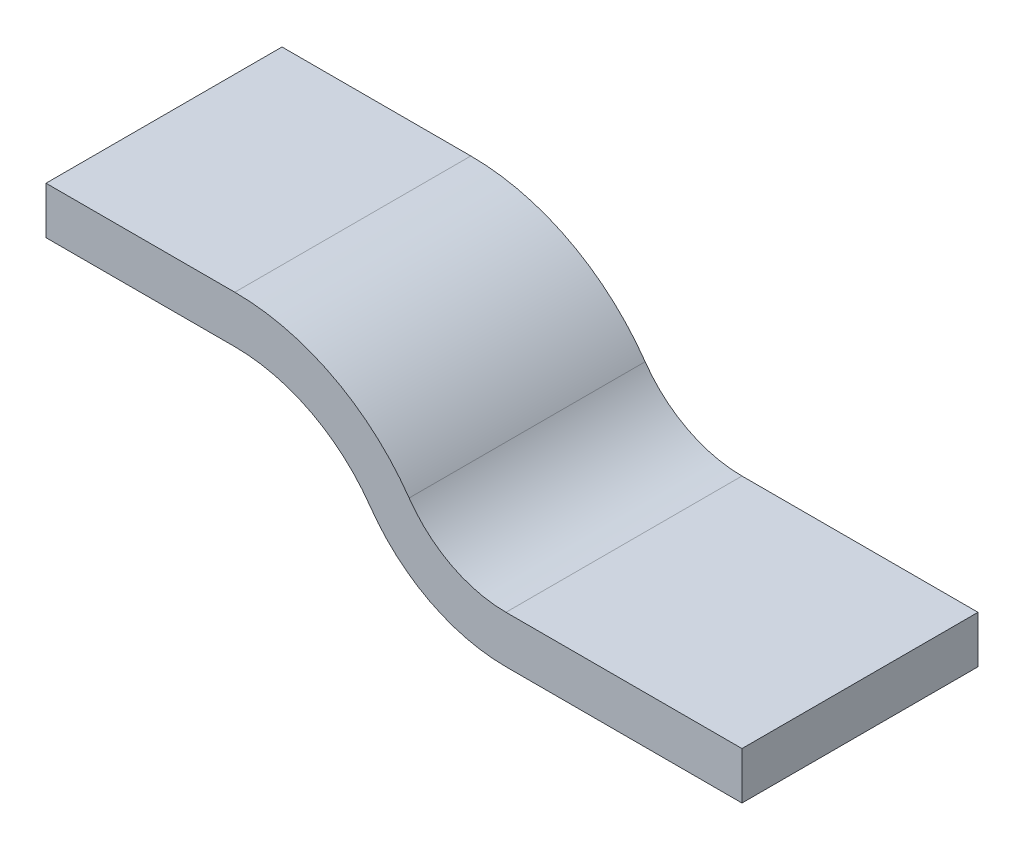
ISO-10303-21;
HEADER;
FILE_DESCRIPTION(('STEP AP214'),'2;1');
FILE_NAME('part.step','',(''),(''),'','','');
FILE_SCHEMA(('AUTOMOTIVE_DESIGN { 1 0 10303 214 1 1 1 1 }'));
ENDSEC;
DATA;
#1=APPLICATION_CONTEXT('core data for automotive mechanical design processes');
#2=APPLICATION_PROTOCOL_DEFINITION('international standard','automotive_design',2000,#1);
#3=PRODUCT_CONTEXT('',#1,'mechanical');
#4=PRODUCT('Part','Part','',(#3));
#5=PRODUCT_RELATED_PRODUCT_CATEGORY('part','',(#4));
#6=PRODUCT_DEFINITION_FORMATION('','',#4);
#7=PRODUCT_DEFINITION_CONTEXT('part definition',#1,'design');
#8=PRODUCT_DEFINITION('design','',#6,#7);
#9=PRODUCT_DEFINITION_SHAPE('','',#8);
#10=(LENGTH_UNIT() NAMED_UNIT(*) SI_UNIT(.MILLI.,.METRE.));
#11=(NAMED_UNIT(*) PLANE_ANGLE_UNIT() SI_UNIT($,.RADIAN.));
#12=(NAMED_UNIT(*) SI_UNIT($,.STERADIAN.) SOLID_ANGLE_UNIT());
#13=UNCERTAINTY_MEASURE_WITH_UNIT(LENGTH_MEASURE(1.E-05),#10,'distance_accuracy_value','');
#14=(GEOMETRIC_REPRESENTATION_CONTEXT(3) GLOBAL_UNCERTAINTY_ASSIGNED_CONTEXT((#13)) GLOBAL_UNIT_ASSIGNED_CONTEXT((#10,
#11,#12)) REPRESENTATION_CONTEXT('',''));
#15=CARTESIAN_POINT('',(0.,0.,0.));
#16=DIRECTION('',(0.,0.,1.));
#17=DIRECTION('',(1.,0.,0.));
#18=AXIS2_PLACEMENT_3D('',#15,#16,#17);
#19=CARTESIAN_POINT('',(97.4456264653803,-35.,25.));
#20=DIRECTION('',(0.,1.,0.));
#21=DIRECTION('',(-1.,0.,0.));
#22=AXIS2_PLACEMENT_3D('',#19,#20,#21);
#23=PLANE('',#22);
#24=DIRECTION('',(1.,0.,0.));
#25=VECTOR('',#24,1.);
#26=CARTESIAN_POINT('',(97.4456264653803,-35.,-25.));
#27=LINE('',#26,#25);
#28=CARTESIAN_POINT('',(97.4456264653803,-35.,-25.));
#29=VERTEX_POINT('',#28);
#30=CARTESIAN_POINT('',(147.44562646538,-35.,-25.));
#31=VERTEX_POINT('',#30);
#32=EDGE_CURVE('E119',#29,#31,#27,.T.);
#33=ORIENTED_EDGE('',*,*,#32,.T.);
#34=DIRECTION('',(0.,0.,-1.));
#35=VECTOR('',#34,1.);
#36=CARTESIAN_POINT('',(147.44562646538,-35.,25.));
#37=LINE('',#36,#35);
#38=CARTESIAN_POINT('',(147.44562646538,-35.,25.));
#39=VERTEX_POINT('',#38);
#40=EDGE_CURVE('E11',#39,#31,#37,.T.);
#41=ORIENTED_EDGE('',*,*,#40,.F.);
#42=DIRECTION('',(1.,0.,0.));
#43=VECTOR('',#42,1.);
#44=CARTESIAN_POINT('',(97.4456264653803,-35.,25.));
#45=LINE('',#44,#43);
#46=CARTESIAN_POINT('',(97.4456264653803,-35.,25.));
#47=VERTEX_POINT('',#46);
#48=EDGE_CURVE('E148',#47,#39,#45,.T.);
#49=ORIENTED_EDGE('',*,*,#48,.F.);
#50=DIRECTION('',(0.,0.,-1.));
#51=VECTOR('',#50,1.);
#52=CARTESIAN_POINT('',(97.4456264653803,-35.,25.));
#53=LINE('',#52,#51);
#54=EDGE_CURVE('E120',#47,#29,#53,.T.);
#55=ORIENTED_EDGE('',*,*,#54,.T.);
#56=EDGE_LOOP('',(#33,#41,#49,#55));
#57=FACE_BOUND('',#56,.T.);
#58=ADVANCED_FACE('F33',(#57),#23,.F.);
#59=CARTESIAN_POINT('',(147.44562646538,-25.,25.));
#60=DIRECTION('',(1.,0.,0.));
#61=DIRECTION('',(0.,0.,-1.));
#62=AXIS2_PLACEMENT_3D('',#59,#60,#61);
#63=PLANE('',#62);
#64=DIRECTION('',(0.,-1.,0.));
#65=VECTOR('',#64,1.);
#66=CARTESIAN_POINT('',(147.44562646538,-25.,-25.));
#67=LINE('',#66,#65);
#68=CARTESIAN_POINT('',(147.44562646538,-25.,-25.));
#69=VERTEX_POINT('',#68);
#70=EDGE_CURVE('E111',#69,#31,#67,.T.);
#71=ORIENTED_EDGE('',*,*,#70,.F.);
#72=DIRECTION('',(0.,0.,-1.));
#73=VECTOR('',#72,1.);
#74=CARTESIAN_POINT('',(147.44562646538,-25.,25.));
#75=LINE('',#74,#73);
#76=CARTESIAN_POINT('',(147.44562646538,-25.,25.));
#77=VERTEX_POINT('',#76);
#78=EDGE_CURVE('E40',#77,#69,#75,.T.);
#79=ORIENTED_EDGE('',*,*,#78,.F.);
#80=DIRECTION('',(0.,-1.,0.));
#81=VECTOR('',#80,1.);
#82=CARTESIAN_POINT('',(147.44562646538,-25.,25.));
#83=LINE('',#82,#81);
#84=EDGE_CURVE('E114',#77,#39,#83,.T.);
#85=ORIENTED_EDGE('',*,*,#84,.T.);
#86=ORIENTED_EDGE('',*,*,#40,.T.);
#87=EDGE_LOOP('',(#71,#79,#85,#86));
#88=FACE_BOUND('',#87,.T.);
#89=ADVANCED_FACE('F109',(#88),#63,.T.);
#90=CARTESIAN_POINT('',(97.4456264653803,-25.,25.));
#91=DIRECTION('',(0.,1.,0.));
#92=DIRECTION('',(-1.,0.,0.));
#93=AXIS2_PLACEMENT_3D('',#90,#91,#92);
#94=PLANE('',#93);
#95=DIRECTION('',(1.,0.,0.));
#96=VECTOR('',#95,1.);
#97=CARTESIAN_POINT('',(97.4456264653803,-25.,-25.));
#98=LINE('',#97,#96);
#99=CARTESIAN_POINT('',(97.4456264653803,-25.,-25.));
#100=VERTEX_POINT('',#99);
#101=EDGE_CURVE('E127',#100,#69,#98,.T.);
#102=ORIENTED_EDGE('',*,*,#101,.F.);
#103=DIRECTION('',(0.,0.,-1.));
#104=VECTOR('',#103,1.);
#105=CARTESIAN_POINT('',(97.4456264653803,-25.,25.));
#106=LINE('',#105,#104);
#107=CARTESIAN_POINT('',(97.4456264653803,-25.,25.));
#108=VERTEX_POINT('',#107);
#109=EDGE_CURVE('E185',#108,#100,#106,.T.);
#110=ORIENTED_EDGE('',*,*,#109,.F.);
#111=DIRECTION('',(1.,0.,0.));
#112=VECTOR('',#111,1.);
#113=CARTESIAN_POINT('',(97.4456264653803,-25.,25.));
#114=LINE('',#113,#112);
#115=EDGE_CURVE('E151',#108,#77,#114,.T.);
#116=ORIENTED_EDGE('',*,*,#115,.T.);
#117=ORIENTED_EDGE('',*,*,#78,.T.);
#118=EDGE_LOOP('',(#102,#110,#116,#117));
#119=FACE_BOUND('',#118,.T.);
#120=ADVANCED_FACE('F187',(#119),#94,.T.);
#121=CARTESIAN_POINT('',(97.4456264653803,0.,25.));
#122=DIRECTION('',(0.,0.,-1.));
#123=DIRECTION('',(-1.,0.,0.));
#124=AXIS2_PLACEMENT_3D('',#121,#122,#123);
#125=CYLINDRICAL_SURFACE('',#124,25.);
#126=CARTESIAN_POINT('',(97.4456264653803,0.,-25.));
#127=DIRECTION('',(0.,0.,1.));
#128=DIRECTION('',(1.,0.,0.));
#129=AXIS2_PLACEMENT_3D('',#126,#127,#128);
#130=CIRCLE('',#129,25.);
#131=CARTESIAN_POINT('',(76.9293312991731,-14.2857142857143,-25.));
#132=VERTEX_POINT('',#131);
#133=EDGE_CURVE('E129',#132,#100,#130,.T.);
#134=ORIENTED_EDGE('',*,*,#133,.F.);
#135=DIRECTION('',(0.,0.,-1.));
#136=VECTOR('',#135,1.);
#137=CARTESIAN_POINT('',(76.9293312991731,-14.2857142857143,25.));
#138=LINE('',#137,#136);
#139=CARTESIAN_POINT('',(76.9293312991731,-14.2857142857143,25.));
#140=VERTEX_POINT('',#139);
#141=EDGE_CURVE('E183',#140,#132,#138,.T.);
#142=ORIENTED_EDGE('',*,*,#141,.F.);
#143=CARTESIAN_POINT('',(97.4456264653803,0.,25.));
#144=DIRECTION('',(0.,0.,1.));
#145=DIRECTION('',(1.,0.,0.));
#146=AXIS2_PLACEMENT_3D('',#143,#144,#145);
#147=CIRCLE('',#146,25.);
#148=EDGE_CURVE('E154',#140,#108,#147,.T.);
#149=ORIENTED_EDGE('',*,*,#148,.T.);
#150=ORIENTED_EDGE('',*,*,#109,.T.);
#151=EDGE_LOOP('',(#134,#142,#149,#150));
#152=FACE_BOUND('',#151,.T.);
#153=ADVANCED_FACE('F194',(#152),#125,.F.);
#154=CARTESIAN_POINT('',(40.,-40.,25.));
#155=DIRECTION('',(0.,0.,-1.));
#156=DIRECTION('',(-1.,0.,0.));
#157=AXIS2_PLACEMENT_3D('',#154,#155,#156);
#158=CYLINDRICAL_SURFACE('',#157,45.);
#159=CARTESIAN_POINT('',(40.,-40.,-25.));
#160=DIRECTION('',(0.,0.,1.));
#161=DIRECTION('',(1.,0.,0.));
#162=AXIS2_PLACEMENT_3D('',#159,#160,#161);
#163=CIRCLE('',#162,45.);
#164=CARTESIAN_POINT('',(40.,5.,-25.));
#165=VERTEX_POINT('',#164);
#166=EDGE_CURVE('E133',#165,#132,#163,.F.);
#167=ORIENTED_EDGE('',*,*,#166,.F.);
#168=DIRECTION('',(0.,0.,-1.));
#169=VECTOR('',#168,1.);
#170=CARTESIAN_POINT('',(40.,5.,25.));
#171=LINE('',#170,#169);
#172=CARTESIAN_POINT('',(40.,5.,25.));
#173=VERTEX_POINT('',#172);
#174=EDGE_CURVE('E181',#173,#165,#171,.T.);
#175=ORIENTED_EDGE('',*,*,#174,.F.);
#176=CARTESIAN_POINT('',(40.,-40.,25.));
#177=DIRECTION('',(0.,0.,1.));
#178=DIRECTION('',(1.,0.,0.));
#179=AXIS2_PLACEMENT_3D('',#176,#177,#178);
#180=CIRCLE('',#179,45.);
#181=EDGE_CURVE('E157',#173,#140,#180,.F.);
#182=ORIENTED_EDGE('',*,*,#181,.T.);
#183=ORIENTED_EDGE('',*,*,#141,.T.);
#184=EDGE_LOOP('',(#167,#175,#182,#183));
#185=FACE_BOUND('',#184,.T.);
#186=ADVANCED_FACE('F197',(#185),#158,.T.);
#187=CARTESIAN_POINT('',(0.,5.,25.));
#188=DIRECTION('',(0.,1.,0.));
#189=DIRECTION('',(0.,0.,1.));
#190=AXIS2_PLACEMENT_3D('',#187,#188,#189);
#191=PLANE('',#190);
#192=DIRECTION('',(1.,0.,0.));
#193=VECTOR('',#192,1.);
#194=CARTESIAN_POINT('',(0.,5.,-25.));
#195=LINE('',#194,#193);
#196=CARTESIAN_POINT('',(0.,5.,-25.));
#197=VERTEX_POINT('',#196);
#198=EDGE_CURVE('E136',#197,#165,#195,.T.);
#199=ORIENTED_EDGE('',*,*,#198,.F.);
#200=DIRECTION('',(0.,0.,-1.));
#201=VECTOR('',#200,1.);
#202=CARTESIAN_POINT('',(0.,5.,25.));
#203=LINE('',#202,#201);
#204=CARTESIAN_POINT('',(0.,5.,25.));
#205=VERTEX_POINT('',#204);
#206=EDGE_CURVE('E179',#205,#197,#203,.T.);
#207=ORIENTED_EDGE('',*,*,#206,.F.);
#208=DIRECTION('',(1.,0.,0.));
#209=VECTOR('',#208,1.);
#210=CARTESIAN_POINT('',(0.,5.,25.));
#211=LINE('',#210,#209);
#212=EDGE_CURVE('E160',#205,#173,#211,.T.);
#213=ORIENTED_EDGE('',*,*,#212,.T.);
#214=ORIENTED_EDGE('',*,*,#174,.T.);
#215=EDGE_LOOP('',(#199,#207,#213,#214));
#216=FACE_BOUND('',#215,.T.);
#217=ADVANCED_FACE('F202',(#216),#191,.T.);
#218=CARTESIAN_POINT('',(0.,-5.,25.));
#219=DIRECTION('',(-1.,0.,0.));
#220=DIRECTION('',(0.,0.,1.));
#221=AXIS2_PLACEMENT_3D('',#218,#219,#220);
#222=PLANE('',#221);
#223=DIRECTION('',(0.,1.,0.));
#224=VECTOR('',#223,1.);
#225=CARTESIAN_POINT('',(0.,-5.,-25.));
#226=LINE('',#225,#224);
#227=CARTESIAN_POINT('',(0.,-5.,-25.));
#228=VERTEX_POINT('',#227);
#229=EDGE_CURVE('E139',#228,#197,#226,.T.);
#230=ORIENTED_EDGE('',*,*,#229,.F.);
#231=DIRECTION('',(0.,0.,-1.));
#232=VECTOR('',#231,1.);
#233=CARTESIAN_POINT('',(0.,-5.,25.));
#234=LINE('',#233,#232);
#235=CARTESIAN_POINT('',(0.,-5.,25.));
#236=VERTEX_POINT('',#235);
#237=EDGE_CURVE('E177',#236,#228,#234,.T.);
#238=ORIENTED_EDGE('',*,*,#237,.F.);
#239=DIRECTION('',(0.,1.,0.));
#240=VECTOR('',#239,1.);
#241=CARTESIAN_POINT('',(0.,-5.,25.));
#242=LINE('',#241,#240);
#243=EDGE_CURVE('E163',#236,#205,#242,.T.);
#244=ORIENTED_EDGE('',*,*,#243,.T.);
#245=ORIENTED_EDGE('',*,*,#206,.T.);
#246=EDGE_LOOP('',(#230,#238,#244,#245));
#247=FACE_BOUND('',#246,.T.);
#248=ADVANCED_FACE('F205',(#247),#222,.T.);
#249=CARTESIAN_POINT('',(0.,-5.,25.));
#250=DIRECTION('',(0.,1.,0.));
#251=DIRECTION('',(0.,0.,1.));
#252=AXIS2_PLACEMENT_3D('',#249,#250,#251);
#253=PLANE('',#252);
#254=DIRECTION('',(1.,0.,0.));
#255=VECTOR('',#254,1.);
#256=CARTESIAN_POINT('',(0.,-5.,-25.));
#257=LINE('',#256,#255);
#258=CARTESIAN_POINT('',(40.,-4.99999999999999,-25.));
#259=VERTEX_POINT('',#258);
#260=EDGE_CURVE('E142',#228,#259,#257,.T.);
#261=ORIENTED_EDGE('',*,*,#260,.T.);
#262=DIRECTION('',(0.,0.,-1.));
#263=VECTOR('',#262,1.);
#264=CARTESIAN_POINT('',(40.,-4.99999999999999,25.));
#265=LINE('',#264,#263);
#266=CARTESIAN_POINT('',(40.,-4.99999999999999,25.));
#267=VERTEX_POINT('',#266);
#268=EDGE_CURVE('E174',#267,#259,#265,.T.);
#269=ORIENTED_EDGE('',*,*,#268,.F.);
#270=DIRECTION('',(1.,0.,0.));
#271=VECTOR('',#270,1.);
#272=CARTESIAN_POINT('',(0.,-5.,25.));
#273=LINE('',#272,#271);
#274=EDGE_CURVE('E166',#236,#267,#273,.T.);
#275=ORIENTED_EDGE('',*,*,#274,.F.);
#276=ORIENTED_EDGE('',*,*,#237,.T.);
#277=EDGE_LOOP('',(#261,#269,#275,#276));
#278=FACE_BOUND('',#277,.T.);
#279=ADVANCED_FACE('F209',(#278),#253,.F.);
#280=CARTESIAN_POINT('',(40.,-40.,25.));
#281=DIRECTION('',(0.,0.,-1.));
#282=DIRECTION('',(-1.,0.,0.));
#283=AXIS2_PLACEMENT_3D('',#280,#281,#282);
#284=CYLINDRICAL_SURFACE('',#283,35.);
#285=CARTESIAN_POINT('',(40.,-40.,-25.));
#286=DIRECTION('',(0.,0.,1.));
#287=DIRECTION('',(1.,0.,0.));
#288=AXIS2_PLACEMENT_3D('',#285,#286,#287);
#289=CIRCLE('',#288,35.);
#290=CARTESIAN_POINT('',(68.7228132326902,-20.,-25.));
#291=VERTEX_POINT('',#290);
#292=EDGE_CURVE('E144',#259,#291,#289,.F.);
#293=ORIENTED_EDGE('',*,*,#292,.T.);
#294=DIRECTION('',(0.,0.,-1.));
#295=VECTOR('',#294,1.);
#296=CARTESIAN_POINT('',(68.7228132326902,-20.,25.));
#297=LINE('',#296,#295);
#298=CARTESIAN_POINT('',(68.7228132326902,-20.,25.));
#299=VERTEX_POINT('',#298);
#300=EDGE_CURVE('E171',#299,#291,#297,.T.);
#301=ORIENTED_EDGE('',*,*,#300,.F.);
#302=CARTESIAN_POINT('',(40.,-40.,25.));
#303=DIRECTION('',(0.,0.,1.));
#304=DIRECTION('',(1.,0.,0.));
#305=AXIS2_PLACEMENT_3D('',#302,#303,#304);
#306=CIRCLE('',#305,35.);
#307=EDGE_CURVE('E52',#267,#299,#306,.F.);
#308=ORIENTED_EDGE('',*,*,#307,.F.);
#309=ORIENTED_EDGE('',*,*,#268,.T.);
#310=EDGE_LOOP('',(#293,#301,#308,#309));
#311=FACE_BOUND('',#310,.T.);
#312=ADVANCED_FACE('F213',(#311),#284,.F.);
#313=CARTESIAN_POINT('',(97.4456264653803,0.,25.));
#314=DIRECTION('',(0.,0.,-1.));
#315=DIRECTION('',(-1.,0.,0.));
#316=AXIS2_PLACEMENT_3D('',#313,#314,#315);
#317=CYLINDRICAL_SURFACE('',#316,35.);
#318=CARTESIAN_POINT('',(97.4456264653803,0.,-25.));
#319=DIRECTION('',(0.,0.,1.));
#320=DIRECTION('',(1.,0.,0.));
#321=AXIS2_PLACEMENT_3D('',#318,#319,#320);
#322=CIRCLE('',#321,35.);
#323=EDGE_CURVE('E146',#291,#29,#322,.T.);
#324=ORIENTED_EDGE('',*,*,#323,.T.);
#325=ORIENTED_EDGE('',*,*,#54,.F.);
#326=CARTESIAN_POINT('',(97.4456264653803,0.,25.));
#327=DIRECTION('',(0.,0.,1.));
#328=DIRECTION('',(1.,0.,0.));
#329=AXIS2_PLACEMENT_3D('',#326,#327,#328);
#330=CIRCLE('',#329,35.);
#331=EDGE_CURVE('E47',#299,#47,#330,.T.);
#332=ORIENTED_EDGE('',*,*,#331,.F.);
#333=ORIENTED_EDGE('',*,*,#300,.T.);
#334=EDGE_LOOP('',(#324,#325,#332,#333));
#335=FACE_BOUND('',#334,.T.);
#336=ADVANCED_FACE('F215',(#335),#317,.T.);
#337=CARTESIAN_POINT('',(97.4456264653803,0.,25.));
#338=DIRECTION('',(0.,0.,1.));
#339=DIRECTION('',(1.,0.,0.));
#340=AXIS2_PLACEMENT_3D('',#337,#338,#339);
#341=PLANE('',#340);
#342=ORIENTED_EDGE('',*,*,#48,.T.);
#343=ORIENTED_EDGE('',*,*,#84,.F.);
#344=ORIENTED_EDGE('',*,*,#115,.F.);
#345=ORIENTED_EDGE('',*,*,#148,.F.);
#346=ORIENTED_EDGE('',*,*,#181,.F.);
#347=ORIENTED_EDGE('',*,*,#212,.F.);
#348=ORIENTED_EDGE('',*,*,#243,.F.);
#349=ORIENTED_EDGE('',*,*,#274,.T.);
#350=ORIENTED_EDGE('',*,*,#307,.T.);
#351=ORIENTED_EDGE('',*,*,#331,.T.);
#352=EDGE_LOOP('',(#342,#343,#344,#345,#346,#347,#348,#349,#350,#351));
#353=FACE_BOUND('',#352,.T.);
#354=ADVANCED_FACE('F189',(#353),#341,.T.);
#355=CARTESIAN_POINT('',(97.4456264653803,0.,-25.));
#356=DIRECTION('',(0.,0.,1.));
#357=DIRECTION('',(1.,0.,0.));
#358=AXIS2_PLACEMENT_3D('',#355,#356,#357);
#359=PLANE('',#358);
#360=ORIENTED_EDGE('',*,*,#32,.F.);
#361=ORIENTED_EDGE('',*,*,#323,.F.);
#362=ORIENTED_EDGE('',*,*,#292,.F.);
#363=ORIENTED_EDGE('',*,*,#260,.F.);
#364=ORIENTED_EDGE('',*,*,#229,.T.);
#365=ORIENTED_EDGE('',*,*,#198,.T.);
#366=ORIENTED_EDGE('',*,*,#166,.T.);
#367=ORIENTED_EDGE('',*,*,#133,.T.);
#368=ORIENTED_EDGE('',*,*,#101,.T.);
#369=ORIENTED_EDGE('',*,*,#70,.T.);
#370=EDGE_LOOP('',(#360,#361,#362,#363,#364,#365,#366,#367,#368,#369));
#371=FACE_BOUND('',#370,.T.);
#372=ADVANCED_FACE('F124',(#371),#359,.F.);
#373=CLOSED_SHELL('',(#58,#89,#120,#153,#186,#217,#248,#279,#312,#336,#354,#372));
#374=MANIFOLD_SOLID_BREP('B2',#373);
#375=ADVANCED_BREP_SHAPE_REPRESENTATION('',(#18,#374),#14);
#376=SHAPE_DEFINITION_REPRESENTATION(#9,#375);
ENDSEC;
END-ISO-10303-21;
